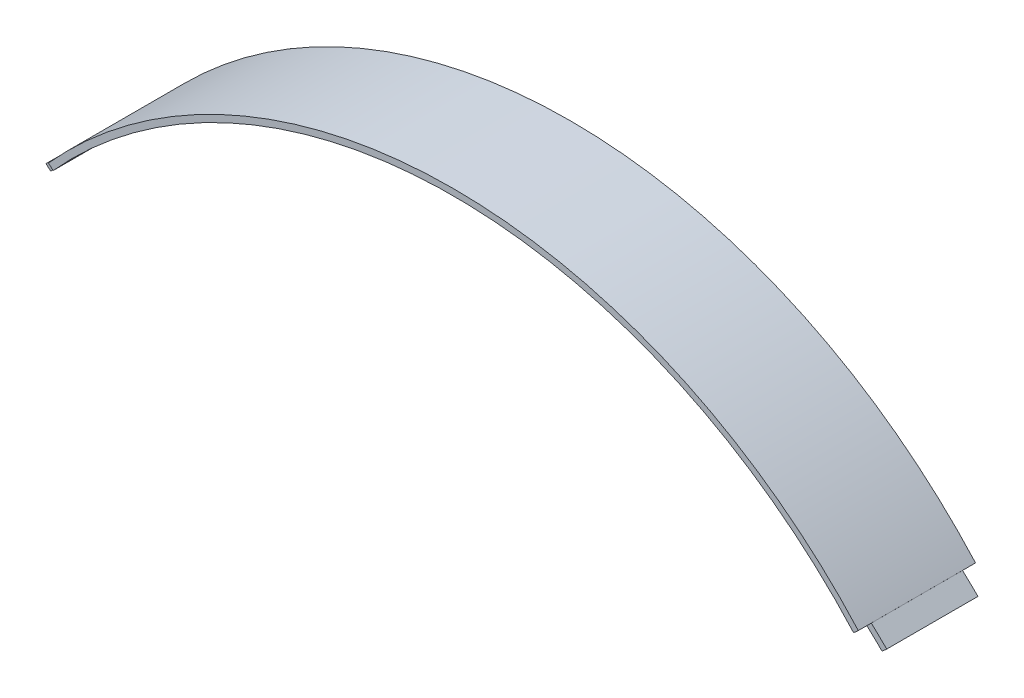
ISO-10303-21;
HEADER;
FILE_DESCRIPTION(('STEP AP214'),'2;1');
FILE_NAME('part.step','',(''),(''),'','','');
FILE_SCHEMA(('AUTOMOTIVE_DESIGN { 1 0 10303 214 1 1 1 1 }'));
ENDSEC;
DATA;
#1=APPLICATION_CONTEXT('core data for automotive mechanical design processes');
#2=APPLICATION_PROTOCOL_DEFINITION('international standard','automotive_design',2000,#1);
#3=PRODUCT_CONTEXT('',#1,'mechanical');
#4=PRODUCT('Part','Part','',(#3));
#5=PRODUCT_RELATED_PRODUCT_CATEGORY('part','',(#4));
#6=PRODUCT_DEFINITION_FORMATION('','',#4);
#7=PRODUCT_DEFINITION_CONTEXT('part definition',#1,'design');
#8=PRODUCT_DEFINITION('design','',#6,#7);
#9=PRODUCT_DEFINITION_SHAPE('','',#8);
#10=(LENGTH_UNIT() NAMED_UNIT(*) SI_UNIT(.MILLI.,.METRE.));
#11=(NAMED_UNIT(*) PLANE_ANGLE_UNIT() SI_UNIT($,.RADIAN.));
#12=(NAMED_UNIT(*) SI_UNIT($,.STERADIAN.) SOLID_ANGLE_UNIT());
#13=UNCERTAINTY_MEASURE_WITH_UNIT(LENGTH_MEASURE(1.E-05),#10,'distance_accuracy_value','');
#14=(GEOMETRIC_REPRESENTATION_CONTEXT(3) GLOBAL_UNCERTAINTY_ASSIGNED_CONTEXT((#13)) GLOBAL_UNIT_ASSIGNED_CONTEXT((#10,
#11,#12)) REPRESENTATION_CONTEXT('',''));
#15=CARTESIAN_POINT('',(0.,0.,0.));
#16=DIRECTION('',(0.,0.,1.));
#17=DIRECTION('',(1.,0.,0.));
#18=AXIS2_PLACEMENT_3D('',#15,#16,#17);
#19=CARTESIAN_POINT('',(450.,22.3938550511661,48.9));
#20=DIRECTION('',(-0.689635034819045,-0.724157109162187,0.));
#21=DIRECTION('',(0.724157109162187,-0.689635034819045,0.));
#22=AXIS2_PLACEMENT_3D('',#19,#20,#21);
#23=PLANE('',#22);
#24=DIRECTION('',(-0.724157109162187,0.689635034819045,0.));
#25=VECTOR('',#24,1.);
#26=CARTESIAN_POINT('',(450.,22.3938550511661,6.1));
#27=LINE('',#26,#25);
#28=CARTESIAN_POINT('',(457.258906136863,15.4809960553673,6.1));
#29=VERTEX_POINT('',#28);
#30=CARTESIAN_POINT('',(450.,22.3938550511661,6.1));
#31=VERTEX_POINT('',#30);
#32=EDGE_CURVE('E80',#29,#31,#27,.T.);
#33=ORIENTED_EDGE('',*,*,#32,.T.);
#34=DIRECTION('',(0.,0.,-1.));
#35=VECTOR('',#34,1.);
#36=CARTESIAN_POINT('',(450.,22.3938550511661,48.9));
#37=LINE('',#36,#35);
#38=CARTESIAN_POINT('',(450.,22.3938550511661,48.9));
#39=VERTEX_POINT('',#38);
#40=EDGE_CURVE('E12',#39,#31,#37,.T.);
#41=ORIENTED_EDGE('',*,*,#40,.F.);
#42=DIRECTION('',(-0.724157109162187,0.689635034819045,0.));
#43=VECTOR('',#42,1.);
#44=CARTESIAN_POINT('',(450.,22.3938550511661,48.9));
#45=LINE('',#44,#43);
#46=CARTESIAN_POINT('',(457.258906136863,15.4809960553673,48.9));
#47=VERTEX_POINT('',#46);
#48=EDGE_CURVE('E98',#47,#39,#45,.T.);
#49=ORIENTED_EDGE('',*,*,#48,.F.);
#50=DIRECTION('',(0.,0.,-1.));
#51=VECTOR('',#50,1.);
#52=CARTESIAN_POINT('',(457.258906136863,15.4809960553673,48.9));
#53=LINE('',#52,#51);
#54=EDGE_CURVE('E92',#47,#29,#53,.T.);
#55=ORIENTED_EDGE('',*,*,#54,.T.);
#56=EDGE_LOOP('',(#33,#41,#49,#55));
#57=FACE_BOUND('',#56,.T.);
#58=ADVANCED_FACE('F36',(#57),#23,.F.);
#59=CARTESIAN_POINT('',(447.81076960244,20.4239633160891,48.9));
#60=DIRECTION('',(0.668886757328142,-0.743364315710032,0.));
#61=DIRECTION('',(0.743364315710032,0.668886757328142,0.));
#62=AXIS2_PLACEMENT_3D('',#59,#60,#61);
#63=PLANE('',#62);
#64=DIRECTION('',(-0.743364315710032,-0.668886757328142,0.));
#65=VECTOR('',#64,1.);
#66=CARTESIAN_POINT('',(447.81076960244,20.4239633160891,6.1));
#67=LINE('',#66,#65);
#68=CARTESIAN_POINT('',(447.81076960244,20.4239633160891,6.1));
#69=VERTEX_POINT('',#68);
#70=EDGE_CURVE('E76',#31,#69,#67,.T.);
#71=ORIENTED_EDGE('',*,*,#70,.T.);
#72=DIRECTION('',(0.,0.,-1.));
#73=VECTOR('',#72,1.);
#74=CARTESIAN_POINT('',(447.81076960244,20.4239633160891,48.9));
#75=LINE('',#74,#73);
#76=CARTESIAN_POINT('',(447.81076960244,20.4239633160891,48.9));
#77=VERTEX_POINT('',#76);
#78=EDGE_CURVE('E43',#77,#69,#75,.T.);
#79=ORIENTED_EDGE('',*,*,#78,.F.);
#80=DIRECTION('',(-0.743364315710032,-0.668886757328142,0.));
#81=VECTOR('',#80,1.);
#82=CARTESIAN_POINT('',(447.81076960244,20.4239633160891,48.9));
#83=LINE('',#82,#81);
#84=EDGE_CURVE('E88',#39,#77,#83,.T.);
#85=ORIENTED_EDGE('',*,*,#84,.F.);
#86=ORIENTED_EDGE('',*,*,#40,.T.);
#87=EDGE_LOOP('',(#71,#79,#85,#86));
#88=FACE_BOUND('',#87,.T.);
#89=ADVANCED_FACE('F87',(#88),#63,.F.);
#90=CARTESIAN_POINT('',(455.064857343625,13.4969387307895,48.9));
#91=DIRECTION('',(0.690614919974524,0.723222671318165,0.));
#92=DIRECTION('',(-0.723222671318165,0.690614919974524,0.));
#93=AXIS2_PLACEMENT_3D('',#90,#91,#92);
#94=PLANE('',#93);
#95=DIRECTION('',(0.723222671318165,-0.690614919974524,0.));
#96=VECTOR('',#95,1.);
#97=CARTESIAN_POINT('',(455.064857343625,13.4969387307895,6.1));
#98=LINE('',#97,#96);
#99=CARTESIAN_POINT('',(455.064857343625,13.4969387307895,6.1));
#100=VERTEX_POINT('',#99);
#101=EDGE_CURVE('E81',#69,#100,#98,.T.);
#102=ORIENTED_EDGE('',*,*,#101,.T.);
#103=DIRECTION('',(0.,0.,-1.));
#104=VECTOR('',#103,1.);
#105=CARTESIAN_POINT('',(455.064857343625,13.4969387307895,48.9));
#106=LINE('',#105,#104);
#107=CARTESIAN_POINT('',(455.064857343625,13.4969387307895,48.9));
#108=VERTEX_POINT('',#107);
#109=EDGE_CURVE('E104',#108,#100,#106,.T.);
#110=ORIENTED_EDGE('',*,*,#109,.F.);
#111=DIRECTION('',(0.723222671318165,-0.690614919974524,0.));
#112=VECTOR('',#111,1.);
#113=CARTESIAN_POINT('',(455.064857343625,13.4969387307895,48.9));
#114=LINE('',#113,#112);
#115=EDGE_CURVE('E55',#77,#108,#114,.T.);
#116=ORIENTED_EDGE('',*,*,#115,.F.);
#117=ORIENTED_EDGE('',*,*,#78,.T.);
#118=EDGE_LOOP('',(#102,#110,#116,#117));
#119=FACE_BOUND('',#118,.T.);
#120=ADVANCED_FACE('F107',(#119),#94,.F.);
#121=CARTESIAN_POINT('',(457.258906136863,15.4809960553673,48.9));
#122=DIRECTION('',(-0.670721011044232,0.741709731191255,0.));
#123=DIRECTION('',(-0.741709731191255,-0.670721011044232,0.));
#124=AXIS2_PLACEMENT_3D('',#121,#122,#123);
#125=PLANE('',#124);
#126=DIRECTION('',(0.741709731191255,0.670721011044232,0.));
#127=VECTOR('',#126,1.);
#128=CARTESIAN_POINT('',(457.258906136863,15.4809960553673,6.1));
#129=LINE('',#128,#127);
#130=EDGE_CURVE('E96',#100,#29,#129,.T.);
#131=ORIENTED_EDGE('',*,*,#130,.T.);
#132=ORIENTED_EDGE('',*,*,#54,.F.);
#133=DIRECTION('',(0.741709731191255,0.670721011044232,0.));
#134=VECTOR('',#133,1.);
#135=CARTESIAN_POINT('',(457.258906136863,15.4809960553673,48.9));
#136=LINE('',#135,#134);
#137=EDGE_CURVE('E50',#108,#47,#136,.T.);
#138=ORIENTED_EDGE('',*,*,#137,.F.);
#139=ORIENTED_EDGE('',*,*,#109,.T.);
#140=EDGE_LOOP('',(#131,#132,#138,#139));
#141=FACE_BOUND('',#140,.T.);
#142=ADVANCED_FACE('F109',(#141),#125,.F.);
#143=CARTESIAN_POINT('',(457.258906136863,15.4809960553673,48.9));
#144=DIRECTION('',(0.,0.,-1.));
#145=DIRECTION('',(-1.,0.,0.));
#146=AXIS2_PLACEMENT_3D('',#143,#144,#145);
#147=PLANE('',#146);
#148=ORIENTED_EDGE('',*,*,#48,.T.);
#149=ORIENTED_EDGE('',*,*,#84,.T.);
#150=ORIENTED_EDGE('',*,*,#115,.T.);
#151=ORIENTED_EDGE('',*,*,#137,.T.);
#152=EDGE_LOOP('',(#148,#149,#150,#151));
#153=FACE_BOUND('',#152,.T.);
#154=ADVANCED_FACE('F110',(#153),#147,.F.);
#155=CARTESIAN_POINT('',(457.258906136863,15.4809960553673,6.1));
#156=DIRECTION('',(0.,0.,-1.));
#157=DIRECTION('',(-1.,0.,0.));
#158=AXIS2_PLACEMENT_3D('',#155,#156,#157);
#159=PLANE('',#158);
#160=ORIENTED_EDGE('',*,*,#32,.F.);
#161=ORIENTED_EDGE('',*,*,#130,.F.);
#162=ORIENTED_EDGE('',*,*,#101,.F.);
#163=ORIENTED_EDGE('',*,*,#70,.F.);
#164=EDGE_LOOP('',(#160,#161,#162,#163));
#165=FACE_BOUND('',#164,.T.);
#166=ADVANCED_FACE('F77',(#165),#159,.T.);
#167=CLOSED_SHELL('',(#58,#89,#120,#142,#154,#166));
#168=MANIFOLD_SOLID_BREP('B2',#167);
#169=CARTESIAN_POINT('',(70.,22.3938550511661,55.));
#170=DIRECTION('',(0.668886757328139,0.743364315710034,0.));
#171=DIRECTION('',(-0.743364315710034,0.668886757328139,0.));
#172=AXIS2_PLACEMENT_3D('',#169,#170,#171);
#173=PLANE('',#172);
#174=DIRECTION('',(-0.743364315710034,0.668886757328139,0.));
#175=VECTOR('',#174,1.);
#176=CARTESIAN_POINT('',(72.1892303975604,20.4239633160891,6.1));
#177=LINE('',#176,#175);
#178=CARTESIAN_POINT('',(72.1892303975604,20.4239633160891,6.1));
#179=VERTEX_POINT('',#178);
#180=CARTESIAN_POINT('',(70.,22.3938550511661,6.1));
#181=VERTEX_POINT('',#180);
#182=EDGE_CURVE('E162',#179,#181,#177,.T.);
#183=ORIENTED_EDGE('',*,*,#182,.T.);
#184=DIRECTION('',(0.,0.,-1.));
#185=VECTOR('',#184,1.);
#186=CARTESIAN_POINT('',(70.,22.3938550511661,55.));
#187=LINE('',#186,#185);
#188=CARTESIAN_POINT('',(70.,22.3938550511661,0.));
#189=VERTEX_POINT('',#188);
#190=EDGE_CURVE('E155',#181,#189,#187,.T.);
#191=ORIENTED_EDGE('',*,*,#190,.T.);
#192=DIRECTION('',(0.743364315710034,-0.668886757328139,0.));
#193=VECTOR('',#192,1.);
#194=CARTESIAN_POINT('',(70.,22.3938550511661,0.));
#195=LINE('',#194,#193);
#196=CARTESIAN_POINT('',(72.1892303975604,20.4239633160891,0.));
#197=VERTEX_POINT('',#196);
#198=EDGE_CURVE('E253',#189,#197,#195,.T.);
#199=ORIENTED_EDGE('',*,*,#198,.T.);
#200=DIRECTION('',(0.,0.,-1.));
#201=VECTOR('',#200,1.);
#202=CARTESIAN_POINT('',(72.1892303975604,20.4239633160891,55.));
#203=LINE('',#202,#201);
#204=EDGE_CURVE('E272',#179,#197,#203,.T.);
#205=ORIENTED_EDGE('',*,*,#204,.F.);
#206=EDGE_LOOP('',(#183,#191,#199,#205));
#207=FACE_BOUND('',#206,.T.);
#208=ADVANCED_FACE('F147',(#207),#173,.F.);
#209=CARTESIAN_POINT('',(260.006239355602,-148.575687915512,55.));
#210=DIRECTION('',(0.,0.,-1.));
#211=DIRECTION('',(-1.,0.,0.));
#212=AXIS2_PLACEMENT_3D('',#209,#210,#211);
#213=CYLINDRICAL_SURFACE('',#212,255.60312129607);
#214=CARTESIAN_POINT('',(260.006239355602,-148.575687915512,0.));
#215=DIRECTION('',(0.,0.,1.));
#216=DIRECTION('',(-1.,0.,0.));
#217=AXIS2_PLACEMENT_3D('',#214,#215,#216);
#218=CIRCLE('',#217,255.60312129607);
#219=CARTESIAN_POINT('',(450.,22.4077221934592,0.));
#220=VERTEX_POINT('',#219);
#221=EDGE_CURVE('E229',#220,#189,#218,.T.);
#222=ORIENTED_EDGE('',*,*,#221,.T.);
#223=ORIENTED_EDGE('',*,*,#190,.F.);
#224=DIRECTION('',(0.,0.,-1.));
#225=VECTOR('',#224,1.);
#226=CARTESIAN_POINT('',(70.,22.3938550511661,48.9));
#227=LINE('',#226,#225);
#228=CARTESIAN_POINT('',(70.,22.3938550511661,48.9));
#229=VERTEX_POINT('',#228);
#230=EDGE_CURVE('E234',#229,#181,#227,.T.);
#231=ORIENTED_EDGE('',*,*,#230,.F.);
#232=CARTESIAN_POINT('',(70.,22.3938550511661,55.));
#233=VERTEX_POINT('',#232);
#234=EDGE_CURVE('E34',#233,#229,#187,.T.);
#235=ORIENTED_EDGE('',*,*,#234,.F.);
#236=CARTESIAN_POINT('',(260.006239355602,-148.575687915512,55.));
#237=DIRECTION('',(0.,0.,1.));
#238=DIRECTION('',(-1.,0.,0.));
#239=AXIS2_PLACEMENT_3D('',#236,#237,#238);
#240=CIRCLE('',#239,255.60312129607);
#241=CARTESIAN_POINT('',(450.,22.4077221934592,55.));
#242=VERTEX_POINT('',#241);
#243=EDGE_CURVE('E260',#242,#233,#240,.T.);
#244=ORIENTED_EDGE('',*,*,#243,.F.);
#245=DIRECTION('',(0.,0.,-1.));
#246=VECTOR('',#245,1.);
#247=CARTESIAN_POINT('',(450.,22.4077221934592,55.));
#248=LINE('',#247,#246);
#249=EDGE_CURVE('E267',#242,#220,#248,.T.);
#250=ORIENTED_EDGE('',*,*,#249,.T.);
#251=EDGE_LOOP('',(#222,#223,#231,#235,#244,#250));
#252=FACE_BOUND('',#251,.T.);
#253=ADVANCED_FACE('F149',(#252),#213,.T.);
#254=ORIENTED_EDGE('',*,*,#234,.T.);
#255=DIRECTION('',(-0.743364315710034,0.668886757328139,0.));
#256=VECTOR('',#255,1.);
#257=CARTESIAN_POINT('',(72.1892303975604,20.4239633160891,48.9));
#258=LINE('',#257,#256);
#259=CARTESIAN_POINT('',(72.1892303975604,20.4239633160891,48.9));
#260=VERTEX_POINT('',#259);
#261=EDGE_CURVE('E244',#260,#229,#258,.T.);
#262=ORIENTED_EDGE('',*,*,#261,.F.);
#263=CARTESIAN_POINT('',(72.1892303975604,20.4239633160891,55.));
#264=VERTEX_POINT('',#263);
#265=EDGE_CURVE('E273',#264,#260,#203,.T.);
#266=ORIENTED_EDGE('',*,*,#265,.F.);
#267=DIRECTION('',(0.743364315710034,-0.668886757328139,0.));
#268=VECTOR('',#267,1.);
#269=CARTESIAN_POINT('',(70.,22.3938550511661,55.));
#270=LINE('',#269,#268);
#271=EDGE_CURVE('E262',#233,#264,#270,.T.);
#272=ORIENTED_EDGE('',*,*,#271,.F.);
#273=EDGE_LOOP('',(#254,#262,#266,#272));
#274=FACE_BOUND('',#273,.T.);
#275=ADVANCED_FACE('F298',(#274),#173,.F.);
#276=CARTESIAN_POINT('',(259.996149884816,-148.700608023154,55.));
#277=DIRECTION('',(0.,0.,-1.));
#278=DIRECTION('',(-1.,0.,0.));
#279=AXIS2_PLACEMENT_3D('',#276,#277,#278);
#280=CYLINDRICAL_SURFACE('',#279,252.73416792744);
#281=CARTESIAN_POINT('',(259.996149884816,-148.700608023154,0.));
#282=DIRECTION('',(0.,0.,-1.));
#283=DIRECTION('',(-1.,0.,0.));
#284=AXIS2_PLACEMENT_3D('',#281,#282,#283);
#285=CIRCLE('',#284,252.73416792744);
#286=CARTESIAN_POINT('',(447.800429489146,20.426894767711,0.));
#287=VERTEX_POINT('',#286);
#288=EDGE_CURVE('E256',#197,#287,#285,.T.);
#289=ORIENTED_EDGE('',*,*,#288,.T.);
#290=DIRECTION('',(0.,0.,-1.));
#291=VECTOR('',#290,1.);
#292=CARTESIAN_POINT('',(447.800429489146,20.426894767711,55.));
#293=LINE('',#292,#291);
#294=CARTESIAN_POINT('',(447.800429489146,20.426894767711,55.));
#295=VERTEX_POINT('',#294);
#296=EDGE_CURVE('E270',#295,#287,#293,.T.);
#297=ORIENTED_EDGE('',*,*,#296,.F.);
#298=CARTESIAN_POINT('',(259.996149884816,-148.700608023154,55.));
#299=DIRECTION('',(0.,0.,-1.));
#300=DIRECTION('',(-1.,0.,0.));
#301=AXIS2_PLACEMENT_3D('',#298,#299,#300);
#302=CIRCLE('',#301,252.73416792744);
#303=EDGE_CURVE('E264',#264,#295,#302,.T.);
#304=ORIENTED_EDGE('',*,*,#303,.F.);
#305=ORIENTED_EDGE('',*,*,#265,.T.);
#306=DIRECTION('',(0.,0.,-1.));
#307=VECTOR('',#306,1.);
#308=CARTESIAN_POINT('',(72.1892303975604,20.4239633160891,48.9));
#309=LINE('',#308,#307);
#310=EDGE_CURVE('E247',#260,#179,#309,.T.);
#311=ORIENTED_EDGE('',*,*,#310,.T.);
#312=ORIENTED_EDGE('',*,*,#204,.T.);
#313=EDGE_LOOP('',(#289,#297,#304,#305,#311,#312));
#314=FACE_BOUND('',#313,.T.);
#315=ADVANCED_FACE('F279',(#314),#280,.F.);
#316=CARTESIAN_POINT('',(450.,22.4077221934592,55.));
#317=DIRECTION('',(-0.669191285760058,0.743090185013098,0.));
#318=DIRECTION('',(-0.743090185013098,-0.669191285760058,0.));
#319=AXIS2_PLACEMENT_3D('',#316,#317,#318);
#320=PLANE('',#319);
#321=DIRECTION('',(0.743090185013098,0.669191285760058,0.));
#322=VECTOR('',#321,1.);
#323=CARTESIAN_POINT('',(450.,22.4077221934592,0.));
#324=LINE('',#323,#322);
#325=EDGE_CURVE('E258',#287,#220,#324,.T.);
#326=ORIENTED_EDGE('',*,*,#325,.T.);
#327=ORIENTED_EDGE('',*,*,#249,.F.);
#328=DIRECTION('',(0.743090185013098,0.669191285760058,0.));
#329=VECTOR('',#328,1.);
#330=CARTESIAN_POINT('',(450.,22.4077221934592,55.));
#331=LINE('',#330,#329);
#332=EDGE_CURVE('E170',#295,#242,#331,.T.);
#333=ORIENTED_EDGE('',*,*,#332,.F.);
#334=ORIENTED_EDGE('',*,*,#296,.T.);
#335=EDGE_LOOP('',(#326,#327,#333,#334));
#336=FACE_BOUND('',#335,.T.);
#337=ADVANCED_FACE('F291',(#336),#320,.F.);
#338=CARTESIAN_POINT('',(260.006239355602,-148.575687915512,55.));
#339=DIRECTION('',(0.,0.,-1.));
#340=DIRECTION('',(-1.,0.,0.));
#341=AXIS2_PLACEMENT_3D('',#338,#339,#340);
#342=PLANE('',#341);
#343=ORIENTED_EDGE('',*,*,#243,.T.);
#344=ORIENTED_EDGE('',*,*,#271,.T.);
#345=ORIENTED_EDGE('',*,*,#303,.T.);
#346=ORIENTED_EDGE('',*,*,#332,.T.);
#347=EDGE_LOOP('',(#343,#344,#345,#346));
#348=FACE_BOUND('',#347,.T.);
#349=ADVANCED_FACE('F295',(#348),#342,.F.);
#350=CARTESIAN_POINT('',(260.006239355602,-148.575687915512,0.));
#351=DIRECTION('',(0.,0.,-1.));
#352=DIRECTION('',(-1.,0.,0.));
#353=AXIS2_PLACEMENT_3D('',#350,#351,#352);
#354=PLANE('',#353);
#355=ORIENTED_EDGE('',*,*,#221,.F.);
#356=ORIENTED_EDGE('',*,*,#325,.F.);
#357=ORIENTED_EDGE('',*,*,#288,.F.);
#358=ORIENTED_EDGE('',*,*,#198,.F.);
#359=EDGE_LOOP('',(#355,#356,#357,#358));
#360=FACE_BOUND('',#359,.T.);
#361=ADVANCED_FACE('F289',(#360),#354,.T.);
#362=CARTESIAN_POINT('',(70.,22.3938550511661,48.9));
#363=DIRECTION('',(0.689635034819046,-0.724157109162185,0.));
#364=DIRECTION('',(0.724157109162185,0.689635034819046,0.));
#365=AXIS2_PLACEMENT_3D('',#362,#363,#364);
#366=PLANE('',#365);
#367=DIRECTION('',(-0.724157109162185,-0.689635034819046,0.));
#368=VECTOR('',#367,1.);
#369=CARTESIAN_POINT('',(70.,22.3938550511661,6.1));
#370=LINE('',#369,#368);
#371=CARTESIAN_POINT('',(62.7410938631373,15.4809960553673,6.1));
#372=VERTEX_POINT('',#371);
#373=EDGE_CURVE('E216',#181,#372,#370,.T.);
#374=ORIENTED_EDGE('',*,*,#373,.T.);
#375=DIRECTION('',(0.,0.,-1.));
#376=VECTOR('',#375,1.);
#377=CARTESIAN_POINT('',(62.7410938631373,15.4809960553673,48.9));
#378=LINE('',#377,#376);
#379=CARTESIAN_POINT('',(62.7410938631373,15.4809960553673,48.9));
#380=VERTEX_POINT('',#379);
#381=EDGE_CURVE('E223',#380,#372,#378,.T.);
#382=ORIENTED_EDGE('',*,*,#381,.F.);
#383=DIRECTION('',(-0.724157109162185,-0.689635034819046,0.));
#384=VECTOR('',#383,1.);
#385=CARTESIAN_POINT('',(70.,22.3938550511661,48.9));
#386=LINE('',#385,#384);
#387=EDGE_CURVE('E239',#229,#380,#386,.T.);
#388=ORIENTED_EDGE('',*,*,#387,.F.);
#389=ORIENTED_EDGE('',*,*,#230,.T.);
#390=EDGE_LOOP('',(#374,#382,#388,#389));
#391=FACE_BOUND('',#390,.T.);
#392=ADVANCED_FACE('F232',(#391),#366,.F.);
#393=CARTESIAN_POINT('',(62.7410938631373,15.4809960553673,48.9));
#394=DIRECTION('',(0.670721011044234,0.741709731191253,0.));
#395=DIRECTION('',(-0.741709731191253,0.670721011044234,0.));
#396=AXIS2_PLACEMENT_3D('',#393,#394,#395);
#397=PLANE('',#396);
#398=DIRECTION('',(0.741709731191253,-0.670721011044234,0.));
#399=VECTOR('',#398,1.);
#400=CARTESIAN_POINT('',(62.7410938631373,15.4809960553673,6.1));
#401=LINE('',#400,#399);
#402=CARTESIAN_POINT('',(64.9351426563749,13.4969387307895,6.1));
#403=VERTEX_POINT('',#402);
#404=EDGE_CURVE('E212',#372,#403,#401,.T.);
#405=ORIENTED_EDGE('',*,*,#404,.T.);
#406=DIRECTION('',(0.,0.,-1.));
#407=VECTOR('',#406,1.);
#408=CARTESIAN_POINT('',(64.9351426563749,13.4969387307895,48.9));
#409=LINE('',#408,#407);
#410=CARTESIAN_POINT('',(64.9351426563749,13.4969387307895,48.9));
#411=VERTEX_POINT('',#410);
#412=EDGE_CURVE('E230',#411,#403,#409,.T.);
#413=ORIENTED_EDGE('',*,*,#412,.F.);
#414=DIRECTION('',(0.741709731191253,-0.670721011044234,0.));
#415=VECTOR('',#414,1.);
#416=CARTESIAN_POINT('',(62.7410938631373,15.4809960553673,48.9));
#417=LINE('',#416,#415);
#418=EDGE_CURVE('E225',#380,#411,#417,.T.);
#419=ORIENTED_EDGE('',*,*,#418,.F.);
#420=ORIENTED_EDGE('',*,*,#381,.T.);
#421=EDGE_LOOP('',(#405,#413,#419,#420));
#422=FACE_BOUND('',#421,.T.);
#423=ADVANCED_FACE('F224',(#422),#397,.F.);
#424=CARTESIAN_POINT('',(64.9351426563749,13.4969387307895,48.9));
#425=DIRECTION('',(-0.690614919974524,0.723222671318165,0.));
#426=DIRECTION('',(-0.723222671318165,-0.690614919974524,0.));
#427=AXIS2_PLACEMENT_3D('',#424,#425,#426);
#428=PLANE('',#427);
#429=DIRECTION('',(0.723222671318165,0.690614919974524,0.));
#430=VECTOR('',#429,1.);
#431=CARTESIAN_POINT('',(64.9351426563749,13.4969387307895,6.1));
#432=LINE('',#431,#430);
#433=EDGE_CURVE('E217',#403,#179,#432,.T.);
#434=ORIENTED_EDGE('',*,*,#433,.T.);
#435=ORIENTED_EDGE('',*,*,#310,.F.);
#436=DIRECTION('',(0.723222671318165,0.690614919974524,0.));
#437=VECTOR('',#436,1.);
#438=CARTESIAN_POINT('',(64.9351426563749,13.4969387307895,48.9));
#439=LINE('',#438,#437);
#440=EDGE_CURVE('E242',#411,#260,#439,.T.);
#441=ORIENTED_EDGE('',*,*,#440,.F.);
#442=ORIENTED_EDGE('',*,*,#412,.T.);
#443=EDGE_LOOP('',(#434,#435,#441,#442));
#444=FACE_BOUND('',#443,.T.);
#445=ADVANCED_FACE('F303',(#444),#428,.F.);
#446=CARTESIAN_POINT('',(62.7410938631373,15.4809960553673,48.9));
#447=DIRECTION('',(0.,0.,1.));
#448=DIRECTION('',(1.,0.,0.));
#449=AXIS2_PLACEMENT_3D('',#446,#447,#448);
#450=PLANE('',#449);
#451=ORIENTED_EDGE('',*,*,#387,.T.);
#452=ORIENTED_EDGE('',*,*,#418,.T.);
#453=ORIENTED_EDGE('',*,*,#440,.T.);
#454=ORIENTED_EDGE('',*,*,#261,.T.);
#455=EDGE_LOOP('',(#451,#452,#453,#454));
#456=FACE_BOUND('',#455,.T.);
#457=ADVANCED_FACE('F300',(#456),#450,.T.);
#458=CARTESIAN_POINT('',(62.7410938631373,15.4809960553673,6.1));
#459=DIRECTION('',(0.,0.,1.));
#460=DIRECTION('',(1.,0.,0.));
#461=AXIS2_PLACEMENT_3D('',#458,#459,#460);
#462=PLANE('',#461);
#463=ORIENTED_EDGE('',*,*,#373,.F.);
#464=ORIENTED_EDGE('',*,*,#182,.F.);
#465=ORIENTED_EDGE('',*,*,#433,.F.);
#466=ORIENTED_EDGE('',*,*,#404,.F.);
#467=EDGE_LOOP('',(#463,#464,#465,#466));
#468=FACE_BOUND('',#467,.T.);
#469=ADVANCED_FACE('F214',(#468),#462,.F.);
#470=CLOSED_SHELL('',(#208,#253,#275,#315,#337,#349,#361,#392,#423,#445,#457,#469));
#471=MANIFOLD_SOLID_BREP('B6',#470);
#472=ADVANCED_BREP_SHAPE_REPRESENTATION('',(#18,#168,#471),#14);
#473=SHAPE_DEFINITION_REPRESENTATION(#9,#472);
ENDSEC;
END-ISO-10303-21;
